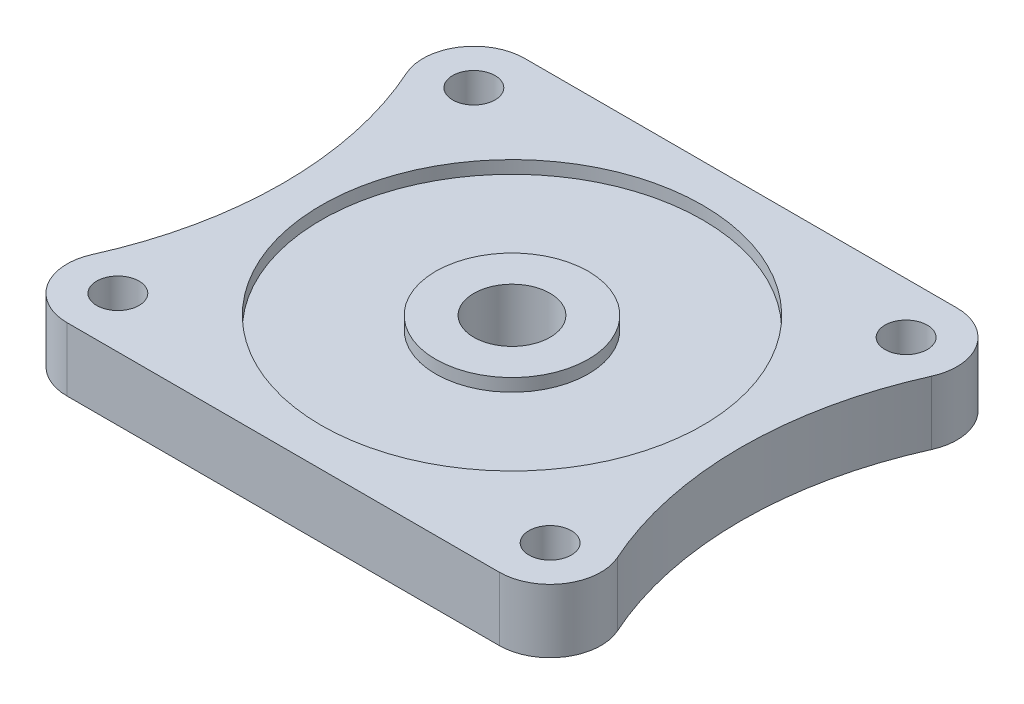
ISO-10303-21;
HEADER;
FILE_DESCRIPTION(('STEP AP214'),'2;1');
FILE_NAME('part.step','',(''),(''),'','','');
FILE_SCHEMA(('AUTOMOTIVE_DESIGN { 1 0 10303 214 1 1 1 1 }'));
ENDSEC;
DATA;
#1=APPLICATION_CONTEXT('core data for automotive mechanical design processes');
#2=APPLICATION_PROTOCOL_DEFINITION('international standard','automotive_design',2000,#1);
#3=PRODUCT_CONTEXT('',#1,'mechanical');
#4=PRODUCT('Part','Part','',(#3));
#5=PRODUCT_RELATED_PRODUCT_CATEGORY('part','',(#4));
#6=PRODUCT_DEFINITION_FORMATION('','',#4);
#7=PRODUCT_DEFINITION_CONTEXT('part definition',#1,'design');
#8=PRODUCT_DEFINITION('design','',#6,#7);
#9=PRODUCT_DEFINITION_SHAPE('','',#8);
#10=(LENGTH_UNIT() NAMED_UNIT(*) SI_UNIT(.MILLI.,.METRE.));
#11=(NAMED_UNIT(*) PLANE_ANGLE_UNIT() SI_UNIT($,.RADIAN.));
#12=(NAMED_UNIT(*) SI_UNIT($,.STERADIAN.) SOLID_ANGLE_UNIT());
#13=UNCERTAINTY_MEASURE_WITH_UNIT(LENGTH_MEASURE(1.E-05),#10,'distance_accuracy_value','');
#14=(GEOMETRIC_REPRESENTATION_CONTEXT(3) GLOBAL_UNCERTAINTY_ASSIGNED_CONTEXT((#13)) GLOBAL_UNIT_ASSIGNED_CONTEXT((#10,
#11,#12)) REPRESENTATION_CONTEXT('',''));
#15=CARTESIAN_POINT('',(0.,0.,0.));
#16=DIRECTION('',(0.,0.,1.));
#17=DIRECTION('',(1.,0.,0.));
#18=AXIS2_PLACEMENT_3D('',#15,#16,#17);
#19=CARTESIAN_POINT('',(-51.,-7.5,-42.));
#20=DIRECTION('',(0.,1.,0.));
#21=DIRECTION('',(0.,0.,1.));
#22=AXIS2_PLACEMENT_3D('',#19,#20,#21);
#23=PLANE('',#22);
#24=CARTESIAN_POINT('',(51.,-7.5,42.));
#25=DIRECTION('',(0.,1.,0.));
#26=DIRECTION('',(0.,0.,1.));
#27=AXIS2_PLACEMENT_3D('',#24,#25,#26);
#28=CIRCLE('',#27,5.00000000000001);
#29=CARTESIAN_POINT('',(51.,-7.5,47.));
#30=VERTEX_POINT('',#29);
#31=EDGE_CURVE('E192',#30,#30,#28,.T.);
#32=ORIENTED_EDGE('',*,*,#31,.T.);
#33=EDGE_LOOP('',(#32));
#34=FACE_BOUND('',#33,.T.);
#35=CARTESIAN_POINT('',(-51.,-7.5,-42.));
#36=DIRECTION('',(0.,1.,0.));
#37=DIRECTION('',(0.,0.,1.));
#38=AXIS2_PLACEMENT_3D('',#35,#36,#37);
#39=CIRCLE('',#38,5.);
#40=CARTESIAN_POINT('',(-51.,-7.5,-37.));
#41=VERTEX_POINT('',#40);
#42=EDGE_CURVE('E180',#41,#41,#39,.T.);
#43=ORIENTED_EDGE('',*,*,#42,.T.);
#44=EDGE_LOOP('',(#43));
#45=FACE_BOUND('',#44,.T.);
#46=CARTESIAN_POINT('',(-51.,-7.5,-42.));
#47=DIRECTION('',(0.,1.,0.));
#48=DIRECTION('',(0.,0.,1.));
#49=AXIS2_PLACEMENT_3D('',#46,#47,#48);
#50=CIRCLE('',#49,12.);
#51=CARTESIAN_POINT('',(-51.,-7.5,-54.));
#52=VERTEX_POINT('',#51);
#53=CARTESIAN_POINT('',(-61.9463414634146,-7.5,-37.0829268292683));
#54=VERTEX_POINT('',#53);
#55=EDGE_CURVE('E132',#52,#54,#50,.T.);
#56=ORIENTED_EDGE('',*,*,#55,.F.);
#57=DIRECTION('',(-1.,0.,0.));
#58=VECTOR('',#57,1.);
#59=CARTESIAN_POINT('',(-51.,-7.5,-54.));
#60=LINE('',#59,#58);
#61=CARTESIAN_POINT('',(51.,-7.5,-54.));
#62=VERTEX_POINT('',#61);
#63=EDGE_CURVE('E86',#62,#52,#60,.T.);
#64=ORIENTED_EDGE('',*,*,#63,.F.);
#65=CARTESIAN_POINT('',(51.,-7.5,-42.));
#66=DIRECTION('',(0.,1.,0.));
#67=DIRECTION('',(0.,0.,1.));
#68=AXIS2_PLACEMENT_3D('',#65,#66,#67);
#69=CIRCLE('',#68,12.);
#70=CARTESIAN_POINT('',(61.9463414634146,-7.5,-37.0829268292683));
#71=VERTEX_POINT('',#70);
#72=EDGE_CURVE('E80',#71,#62,#69,.T.);
#73=ORIENTED_EDGE('',*,*,#72,.F.);
#74=CARTESIAN_POINT('',(144.5,-7.5,0.));
#75=DIRECTION('',(0.,-1.,0.));
#76=DIRECTION('',(0.,0.,-1.));
#77=AXIS2_PLACEMENT_3D('',#74,#75,#76);
#78=CIRCLE('',#77,90.5);
#79=CARTESIAN_POINT('',(61.9463414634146,-7.5,37.0829268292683));
#80=VERTEX_POINT('',#79);
#81=EDGE_CURVE('E122',#80,#71,#78,.T.);
#82=ORIENTED_EDGE('',*,*,#81,.F.);
#83=CARTESIAN_POINT('',(51.,-7.5,42.));
#84=DIRECTION('',(0.,1.,0.));
#85=DIRECTION('',(0.,0.,1.));
#86=AXIS2_PLACEMENT_3D('',#83,#84,#85);
#87=CIRCLE('',#86,12.);
#88=CARTESIAN_POINT('',(51.,-7.5,54.));
#89=VERTEX_POINT('',#88);
#90=EDGE_CURVE('E142',#89,#80,#87,.T.);
#91=ORIENTED_EDGE('',*,*,#90,.F.);
#92=DIRECTION('',(1.,0.,0.));
#93=VECTOR('',#92,1.);
#94=CARTESIAN_POINT('',(-51.,-7.5,54.));
#95=LINE('',#94,#93);
#96=CARTESIAN_POINT('',(-51.,-7.5,54.));
#97=VERTEX_POINT('',#96);
#98=EDGE_CURVE('E140',#97,#89,#95,.T.);
#99=ORIENTED_EDGE('',*,*,#98,.F.);
#100=CARTESIAN_POINT('',(-51.,-7.5,42.));
#101=DIRECTION('',(0.,1.,0.));
#102=DIRECTION('',(0.,0.,1.));
#103=AXIS2_PLACEMENT_3D('',#100,#101,#102);
#104=CIRCLE('',#103,12.);
#105=CARTESIAN_POINT('',(-61.9463414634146,-7.5,37.0829268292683));
#106=VERTEX_POINT('',#105);
#107=EDGE_CURVE('E138',#106,#97,#104,.T.);
#108=ORIENTED_EDGE('',*,*,#107,.F.);
#109=CARTESIAN_POINT('',(-144.5,-7.5,0.));
#110=DIRECTION('',(0.,-1.,0.));
#111=DIRECTION('',(0.,0.,1.));
#112=AXIS2_PLACEMENT_3D('',#109,#110,#111);
#113=CIRCLE('',#112,90.5);
#114=EDGE_CURVE('E135',#54,#106,#113,.T.);
#115=ORIENTED_EDGE('',*,*,#114,.F.);
#116=EDGE_LOOP('',(#56,#64,#73,#82,#91,#99,#108,#115));
#117=FACE_BOUND('',#116,.T.);
#118=CARTESIAN_POINT('',(51.,-7.5,-42.));
#119=DIRECTION('',(0.,1.,0.));
#120=DIRECTION('',(0.,0.,1.));
#121=AXIS2_PLACEMENT_3D('',#118,#119,#120);
#122=CIRCLE('',#121,5.00000000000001);
#123=CARTESIAN_POINT('',(51.,-7.5,-37.));
#124=VERTEX_POINT('',#123);
#125=EDGE_CURVE('E186',#124,#124,#122,.T.);
#126=ORIENTED_EDGE('',*,*,#125,.T.);
#127=EDGE_LOOP('',(#126));
#128=FACE_BOUND('',#127,.T.);
#129=CARTESIAN_POINT('',(-51.,-7.5,42.));
#130=DIRECTION('',(0.,1.,0.));
#131=DIRECTION('',(0.,0.,1.));
#132=AXIS2_PLACEMENT_3D('',#129,#130,#131);
#133=CIRCLE('',#132,5.00000000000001);
#134=CARTESIAN_POINT('',(-51.,-7.5,47.));
#135=VERTEX_POINT('',#134);
#136=EDGE_CURVE('E198',#135,#135,#133,.T.);
#137=ORIENTED_EDGE('',*,*,#136,.T.);
#138=EDGE_LOOP('',(#137));
#139=FACE_BOUND('',#138,.T.);
#140=CARTESIAN_POINT('',(0.,-7.5,0.));
#141=DIRECTION('',(0.,1.,0.));
#142=DIRECTION('',(0.,0.,1.));
#143=AXIS2_PLACEMENT_3D('',#140,#141,#142);
#144=CIRCLE('',#143,45.);
#145=CARTESIAN_POINT('',(0.,-7.5,45.));
#146=VERTEX_POINT('',#145);
#147=EDGE_CURVE('E222',#146,#146,#144,.T.);
#148=ORIENTED_EDGE('',*,*,#147,.T.);
#149=EDGE_LOOP('',(#148));
#150=FACE_BOUND('',#149,.T.);
#151=ADVANCED_FACE('F34',(#34,#45,#117,#128,#139,#150),#23,.F.);
#152=CARTESIAN_POINT('',(-51.,7.5,-42.));
#153=DIRECTION('',(0.,1.,0.));
#154=DIRECTION('',(0.,0.,1.));
#155=AXIS2_PLACEMENT_3D('',#152,#153,#154);
#156=PLANE('',#155);
#157=CARTESIAN_POINT('',(0.,7.5,0.));
#158=DIRECTION('',(0.,1.,0.));
#159=DIRECTION('',(0.,0.,1.));
#160=AXIS2_PLACEMENT_3D('',#157,#158,#159);
#161=CIRCLE('',#160,9.);
#162=CARTESIAN_POINT('',(0.,7.5,9.));
#163=VERTEX_POINT('',#162);
#164=EDGE_CURVE('E204',#163,#163,#161,.T.);
#165=ORIENTED_EDGE('',*,*,#164,.F.);
#166=EDGE_LOOP('',(#165));
#167=FACE_BOUND('',#166,.T.);
#168=CARTESIAN_POINT('',(0.,7.5,0.));
#169=DIRECTION('',(0.,1.,0.));
#170=DIRECTION('',(0.,0.,1.));
#171=AXIS2_PLACEMENT_3D('',#168,#169,#170);
#172=CIRCLE('',#171,18.);
#173=CARTESIAN_POINT('',(0.,7.5,18.));
#174=VERTEX_POINT('',#173);
#175=EDGE_CURVE('E216',#174,#174,#172,.T.);
#176=ORIENTED_EDGE('',*,*,#175,.T.);
#177=EDGE_LOOP('',(#176));
#178=FACE_BOUND('',#177,.T.);
#179=ADVANCED_FACE('F257',(#167,#178),#156,.T.);
#180=CARTESIAN_POINT('',(0.,7.5,0.));
#181=DIRECTION('',(0.,1.,0.));
#182=DIRECTION('',(0.,0.,1.));
#183=AXIS2_PLACEMENT_3D('',#180,#181,#182);
#184=CIRCLE('',#183,45.);
#185=CARTESIAN_POINT('',(0.,7.5,45.));
#186=VERTEX_POINT('',#185);
#187=EDGE_CURVE('E210',#186,#186,#184,.T.);
#188=ORIENTED_EDGE('',*,*,#187,.F.);
#189=EDGE_LOOP('',(#188));
#190=FACE_BOUND('',#189,.T.);
#191=CARTESIAN_POINT('',(51.,7.5,42.));
#192=DIRECTION('',(0.,1.,0.));
#193=DIRECTION('',(0.,0.,1.));
#194=AXIS2_PLACEMENT_3D('',#191,#192,#193);
#195=CIRCLE('',#194,5.00000000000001);
#196=CARTESIAN_POINT('',(51.,7.5,47.));
#197=VERTEX_POINT('',#196);
#198=EDGE_CURVE('E189',#197,#197,#195,.T.);
#199=ORIENTED_EDGE('',*,*,#198,.F.);
#200=EDGE_LOOP('',(#199));
#201=FACE_BOUND('',#200,.T.);
#202=CARTESIAN_POINT('',(-51.,7.5,-42.));
#203=DIRECTION('',(0.,1.,0.));
#204=DIRECTION('',(0.,0.,1.));
#205=AXIS2_PLACEMENT_3D('',#202,#203,#204);
#206=CIRCLE('',#205,5.);
#207=CARTESIAN_POINT('',(-51.,7.5,-37.));
#208=VERTEX_POINT('',#207);
#209=EDGE_CURVE('E136',#208,#208,#206,.T.);
#210=ORIENTED_EDGE('',*,*,#209,.F.);
#211=EDGE_LOOP('',(#210));
#212=FACE_BOUND('',#211,.T.);
#213=CARTESIAN_POINT('',(-51.,7.5,-42.));
#214=DIRECTION('',(0.,1.,0.));
#215=DIRECTION('',(0.,0.,1.));
#216=AXIS2_PLACEMENT_3D('',#213,#214,#215);
#217=CIRCLE('',#216,12.);
#218=CARTESIAN_POINT('',(-51.,7.5,-54.));
#219=VERTEX_POINT('',#218);
#220=CARTESIAN_POINT('',(-61.9463414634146,7.5,-37.0829268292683));
#221=VERTEX_POINT('',#220);
#222=EDGE_CURVE('E147',#219,#221,#217,.T.);
#223=ORIENTED_EDGE('',*,*,#222,.T.);
#224=CARTESIAN_POINT('',(-144.5,7.5,0.));
#225=DIRECTION('',(0.,-1.,0.));
#226=DIRECTION('',(0.,0.,1.));
#227=AXIS2_PLACEMENT_3D('',#224,#225,#226);
#228=CIRCLE('',#227,90.5);
#229=CARTESIAN_POINT('',(-61.9463414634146,7.5,37.0829268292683));
#230=VERTEX_POINT('',#229);
#231=EDGE_CURVE('E94',#221,#230,#228,.T.);
#232=ORIENTED_EDGE('',*,*,#231,.T.);
#233=CARTESIAN_POINT('',(-51.,7.5,42.));
#234=DIRECTION('',(0.,1.,0.));
#235=DIRECTION('',(0.,0.,1.));
#236=AXIS2_PLACEMENT_3D('',#233,#234,#235);
#237=CIRCLE('',#236,12.);
#238=CARTESIAN_POINT('',(-51.,7.5,54.));
#239=VERTEX_POINT('',#238);
#240=EDGE_CURVE('E162',#230,#239,#237,.T.);
#241=ORIENTED_EDGE('',*,*,#240,.T.);
#242=DIRECTION('',(1.,0.,0.));
#243=VECTOR('',#242,1.);
#244=CARTESIAN_POINT('',(-51.,7.5,54.));
#245=LINE('',#244,#243);
#246=CARTESIAN_POINT('',(51.,7.5,54.));
#247=VERTEX_POINT('',#246);
#248=EDGE_CURVE('E174',#239,#247,#245,.T.);
#249=ORIENTED_EDGE('',*,*,#248,.T.);
#250=CARTESIAN_POINT('',(51.,7.5,42.));
#251=DIRECTION('',(0.,1.,0.));
#252=DIRECTION('',(0.,0.,1.));
#253=AXIS2_PLACEMENT_3D('',#250,#251,#252);
#254=CIRCLE('',#253,12.);
#255=CARTESIAN_POINT('',(61.9463414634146,7.5,37.0829268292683));
#256=VERTEX_POINT('',#255);
#257=EDGE_CURVE('E114',#247,#256,#254,.T.);
#258=ORIENTED_EDGE('',*,*,#257,.T.);
#259=CARTESIAN_POINT('',(144.5,7.5,0.));
#260=DIRECTION('',(0.,-1.,0.));
#261=DIRECTION('',(0.,0.,-1.));
#262=AXIS2_PLACEMENT_3D('',#259,#260,#261);
#263=CIRCLE('',#262,90.5);
#264=CARTESIAN_POINT('',(61.9463414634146,7.5,-37.0829268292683));
#265=VERTEX_POINT('',#264);
#266=EDGE_CURVE('E107',#256,#265,#263,.T.);
#267=ORIENTED_EDGE('',*,*,#266,.T.);
#268=CARTESIAN_POINT('',(51.,7.5,-42.));
#269=DIRECTION('',(0.,1.,0.));
#270=DIRECTION('',(0.,0.,1.));
#271=AXIS2_PLACEMENT_3D('',#268,#269,#270);
#272=CIRCLE('',#271,12.);
#273=CARTESIAN_POINT('',(51.,7.5,-54.));
#274=VERTEX_POINT('',#273);
#275=EDGE_CURVE('E112',#265,#274,#272,.T.);
#276=ORIENTED_EDGE('',*,*,#275,.T.);
#277=DIRECTION('',(-1.,0.,0.));
#278=VECTOR('',#277,1.);
#279=CARTESIAN_POINT('',(-51.,7.5,-54.));
#280=LINE('',#279,#278);
#281=EDGE_CURVE('E51',#274,#219,#280,.T.);
#282=ORIENTED_EDGE('',*,*,#281,.T.);
#283=EDGE_LOOP('',(#223,#232,#241,#249,#258,#267,#276,#282));
#284=FACE_BOUND('',#283,.T.);
#285=CARTESIAN_POINT('',(51.,7.5,-42.));
#286=DIRECTION('',(0.,1.,0.));
#287=DIRECTION('',(0.,0.,1.));
#288=AXIS2_PLACEMENT_3D('',#285,#286,#287);
#289=CIRCLE('',#288,5.00000000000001);
#290=CARTESIAN_POINT('',(51.,7.5,-37.));
#291=VERTEX_POINT('',#290);
#292=EDGE_CURVE('E183',#291,#291,#289,.T.);
#293=ORIENTED_EDGE('',*,*,#292,.F.);
#294=EDGE_LOOP('',(#293));
#295=FACE_BOUND('',#294,.T.);
#296=CARTESIAN_POINT('',(-51.,7.5,42.));
#297=DIRECTION('',(0.,1.,0.));
#298=DIRECTION('',(0.,0.,1.));
#299=AXIS2_PLACEMENT_3D('',#296,#297,#298);
#300=CIRCLE('',#299,5.00000000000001);
#301=CARTESIAN_POINT('',(-51.,7.5,47.));
#302=VERTEX_POINT('',#301);
#303=EDGE_CURVE('E195',#302,#302,#300,.T.);
#304=ORIENTED_EDGE('',*,*,#303,.F.);
#305=EDGE_LOOP('',(#304));
#306=FACE_BOUND('',#305,.T.);
#307=ADVANCED_FACE('F109',(#190,#201,#212,#284,#295,#306),#156,.T.);
#308=CARTESIAN_POINT('',(0.,-7.5,0.));
#309=DIRECTION('',(0.,1.,0.));
#310=DIRECTION('',(0.,0.,1.));
#311=AXIS2_PLACEMENT_3D('',#308,#309,#310);
#312=CIRCLE('',#311,18.);
#313=CARTESIAN_POINT('',(0.,-7.5,18.));
#314=VERTEX_POINT('',#313);
#315=EDGE_CURVE('E228',#314,#314,#312,.T.);
#316=ORIENTED_EDGE('',*,*,#315,.F.);
#317=EDGE_LOOP('',(#316));
#318=FACE_BOUND('',#317,.T.);
#319=CARTESIAN_POINT('',(0.,-7.5,0.));
#320=DIRECTION('',(0.,1.,0.));
#321=DIRECTION('',(0.,0.,1.));
#322=AXIS2_PLACEMENT_3D('',#319,#320,#321);
#323=CIRCLE('',#322,9.);
#324=CARTESIAN_POINT('',(0.,-7.5,9.));
#325=VERTEX_POINT('',#324);
#326=EDGE_CURVE('E201',#325,#325,#323,.T.);
#327=ORIENTED_EDGE('',*,*,#326,.T.);
#328=EDGE_LOOP('',(#327));
#329=FACE_BOUND('',#328,.T.);
#330=ADVANCED_FACE('F243',(#318,#329),#23,.F.);
#331=CARTESIAN_POINT('',(-51.,7.5,-42.));
#332=DIRECTION('',(0.,-1.,0.));
#333=DIRECTION('',(0.,0.,-1.));
#334=AXIS2_PLACEMENT_3D('',#331,#332,#333);
#335=CYLINDRICAL_SURFACE('',#334,12.);
#336=ORIENTED_EDGE('',*,*,#55,.T.);
#337=DIRECTION('',(0.,-1.,0.));
#338=VECTOR('',#337,1.);
#339=CARTESIAN_POINT('',(-61.9463414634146,7.5,-37.0829268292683));
#340=LINE('',#339,#338);
#341=EDGE_CURVE('E11',#221,#54,#340,.T.);
#342=ORIENTED_EDGE('',*,*,#341,.F.);
#343=ORIENTED_EDGE('',*,*,#222,.F.);
#344=DIRECTION('',(0.,-1.,0.));
#345=VECTOR('',#344,1.);
#346=CARTESIAN_POINT('',(-51.,7.5,-54.));
#347=LINE('',#346,#345);
#348=EDGE_CURVE('E128',#219,#52,#347,.T.);
#349=ORIENTED_EDGE('',*,*,#348,.T.);
#350=EDGE_LOOP('',(#336,#342,#343,#349));
#351=FACE_BOUND('',#350,.T.);
#352=ADVANCED_FACE('F36',(#351),#335,.T.);
#353=CARTESIAN_POINT('',(-144.5,7.5,0.));
#354=DIRECTION('',(0.,-1.,0.));
#355=DIRECTION('',(0.,0.,-1.));
#356=AXIS2_PLACEMENT_3D('',#353,#354,#355);
#357=CYLINDRICAL_SURFACE('',#356,90.5);
#358=ORIENTED_EDGE('',*,*,#114,.T.);
#359=DIRECTION('',(0.,-1.,0.));
#360=VECTOR('',#359,1.);
#361=CARTESIAN_POINT('',(-61.9463414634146,7.5,37.0829268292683));
#362=LINE('',#361,#360);
#363=EDGE_CURVE('E43',#230,#106,#362,.T.);
#364=ORIENTED_EDGE('',*,*,#363,.F.);
#365=ORIENTED_EDGE('',*,*,#231,.F.);
#366=ORIENTED_EDGE('',*,*,#341,.T.);
#367=EDGE_LOOP('',(#358,#364,#365,#366));
#368=FACE_BOUND('',#367,.T.);
#369=ADVANCED_FACE('F297',(#368),#357,.F.);
#370=CARTESIAN_POINT('',(-51.,7.5,42.));
#371=DIRECTION('',(0.,-1.,0.));
#372=DIRECTION('',(0.,0.,-1.));
#373=AXIS2_PLACEMENT_3D('',#370,#371,#372);
#374=CYLINDRICAL_SURFACE('',#373,12.);
#375=ORIENTED_EDGE('',*,*,#107,.T.);
#376=DIRECTION('',(0.,-1.,0.));
#377=VECTOR('',#376,1.);
#378=CARTESIAN_POINT('',(-51.,7.5,54.));
#379=LINE('',#378,#377);
#380=EDGE_CURVE('E154',#239,#97,#379,.T.);
#381=ORIENTED_EDGE('',*,*,#380,.F.);
#382=ORIENTED_EDGE('',*,*,#240,.F.);
#383=ORIENTED_EDGE('',*,*,#363,.T.);
#384=EDGE_LOOP('',(#375,#381,#382,#383));
#385=FACE_BOUND('',#384,.T.);
#386=ADVANCED_FACE('F160',(#385),#374,.T.);
#387=CARTESIAN_POINT('',(-51.,7.5,54.));
#388=DIRECTION('',(0.,0.,-1.));
#389=DIRECTION('',(-1.,0.,0.));
#390=AXIS2_PLACEMENT_3D('',#387,#388,#389);
#391=PLANE('',#390);
#392=ORIENTED_EDGE('',*,*,#98,.T.);
#393=DIRECTION('',(0.,-1.,0.));
#394=VECTOR('',#393,1.);
#395=CARTESIAN_POINT('',(51.,7.5,54.));
#396=LINE('',#395,#394);
#397=EDGE_CURVE('E151',#247,#89,#396,.T.);
#398=ORIENTED_EDGE('',*,*,#397,.F.);
#399=ORIENTED_EDGE('',*,*,#248,.F.);
#400=ORIENTED_EDGE('',*,*,#380,.T.);
#401=EDGE_LOOP('',(#392,#398,#399,#400));
#402=FACE_BOUND('',#401,.T.);
#403=ADVANCED_FACE('F170',(#402),#391,.F.);
#404=CARTESIAN_POINT('',(51.,7.5,42.));
#405=DIRECTION('',(0.,-1.,0.));
#406=DIRECTION('',(0.,0.,-1.));
#407=AXIS2_PLACEMENT_3D('',#404,#405,#406);
#408=CYLINDRICAL_SURFACE('',#407,12.);
#409=ORIENTED_EDGE('',*,*,#90,.T.);
#410=DIRECTION('',(0.,-1.,0.));
#411=VECTOR('',#410,1.);
#412=CARTESIAN_POINT('',(61.9463414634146,7.5,37.0829268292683));
#413=LINE('',#412,#411);
#414=EDGE_CURVE('E123',#256,#80,#413,.T.);
#415=ORIENTED_EDGE('',*,*,#414,.F.);
#416=ORIENTED_EDGE('',*,*,#257,.F.);
#417=ORIENTED_EDGE('',*,*,#397,.T.);
#418=EDGE_LOOP('',(#409,#415,#416,#417));
#419=FACE_BOUND('',#418,.T.);
#420=ADVANCED_FACE('F173',(#419),#408,.T.);
#421=CARTESIAN_POINT('',(144.5,7.5,0.));
#422=DIRECTION('',(0.,-1.,0.));
#423=DIRECTION('',(0.,0.,-1.));
#424=AXIS2_PLACEMENT_3D('',#421,#422,#423);
#425=CYLINDRICAL_SURFACE('',#424,90.5);
#426=ORIENTED_EDGE('',*,*,#81,.T.);
#427=DIRECTION('',(0.,-1.,0.));
#428=VECTOR('',#427,1.);
#429=CARTESIAN_POINT('',(61.9463414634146,7.5,-37.0829268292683));
#430=LINE('',#429,#428);
#431=EDGE_CURVE('E119',#265,#71,#430,.T.);
#432=ORIENTED_EDGE('',*,*,#431,.F.);
#433=ORIENTED_EDGE('',*,*,#266,.F.);
#434=ORIENTED_EDGE('',*,*,#414,.T.);
#435=EDGE_LOOP('',(#426,#432,#433,#434));
#436=FACE_BOUND('',#435,.T.);
#437=ADVANCED_FACE('F120',(#436),#425,.F.);
#438=CARTESIAN_POINT('',(51.,7.5,-42.));
#439=DIRECTION('',(0.,-1.,0.));
#440=DIRECTION('',(0.,0.,-1.));
#441=AXIS2_PLACEMENT_3D('',#438,#439,#440);
#442=CYLINDRICAL_SURFACE('',#441,12.);
#443=ORIENTED_EDGE('',*,*,#72,.T.);
#444=DIRECTION('',(0.,-1.,0.));
#445=VECTOR('',#444,1.);
#446=CARTESIAN_POINT('',(51.,7.5,-54.));
#447=LINE('',#446,#445);
#448=EDGE_CURVE('E124',#274,#62,#447,.T.);
#449=ORIENTED_EDGE('',*,*,#448,.F.);
#450=ORIENTED_EDGE('',*,*,#275,.F.);
#451=ORIENTED_EDGE('',*,*,#431,.T.);
#452=EDGE_LOOP('',(#443,#449,#450,#451));
#453=FACE_BOUND('',#452,.T.);
#454=ADVANCED_FACE('F126',(#453),#442,.T.);
#455=CARTESIAN_POINT('',(-51.,7.5,-54.));
#456=DIRECTION('',(0.,0.,1.));
#457=DIRECTION('',(1.,0.,0.));
#458=AXIS2_PLACEMENT_3D('',#455,#456,#457);
#459=PLANE('',#458);
#460=ORIENTED_EDGE('',*,*,#63,.T.);
#461=ORIENTED_EDGE('',*,*,#348,.F.);
#462=ORIENTED_EDGE('',*,*,#281,.F.);
#463=ORIENTED_EDGE('',*,*,#448,.T.);
#464=EDGE_LOOP('',(#460,#461,#462,#463));
#465=FACE_BOUND('',#464,.T.);
#466=ADVANCED_FACE('F284',(#465),#459,.F.);
#467=CARTESIAN_POINT('',(-51.,7.5,-42.));
#468=DIRECTION('',(0.,-1.,0.));
#469=DIRECTION('',(0.,0.,-1.));
#470=AXIS2_PLACEMENT_3D('',#467,#468,#469);
#471=CYLINDRICAL_SURFACE('',#470,5.);
#472=ORIENTED_EDGE('',*,*,#209,.T.);
#473=EDGE_LOOP('',(#472));
#474=FACE_BOUND('',#473,.T.);
#475=ORIENTED_EDGE('',*,*,#42,.F.);
#476=EDGE_LOOP('',(#475));
#477=FACE_BOUND('',#476,.T.);
#478=ADVANCED_FACE('F287',(#474,#477),#471,.F.);
#479=CARTESIAN_POINT('',(51.,7.5,-42.));
#480=DIRECTION('',(0.,-1.,0.));
#481=DIRECTION('',(0.,0.,-1.));
#482=AXIS2_PLACEMENT_3D('',#479,#480,#481);
#483=CYLINDRICAL_SURFACE('',#482,5.00000000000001);
#484=ORIENTED_EDGE('',*,*,#292,.T.);
#485=EDGE_LOOP('',(#484));
#486=FACE_BOUND('',#485,.T.);
#487=ORIENTED_EDGE('',*,*,#125,.F.);
#488=EDGE_LOOP('',(#487));
#489=FACE_BOUND('',#488,.T.);
#490=ADVANCED_FACE('F350',(#486,#489),#483,.F.);
#491=CARTESIAN_POINT('',(51.,7.5,42.));
#492=DIRECTION('',(0.,-1.,0.));
#493=DIRECTION('',(0.,0.,-1.));
#494=AXIS2_PLACEMENT_3D('',#491,#492,#493);
#495=CYLINDRICAL_SURFACE('',#494,5.00000000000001);
#496=ORIENTED_EDGE('',*,*,#198,.T.);
#497=EDGE_LOOP('',(#496));
#498=FACE_BOUND('',#497,.T.);
#499=ORIENTED_EDGE('',*,*,#31,.F.);
#500=EDGE_LOOP('',(#499));
#501=FACE_BOUND('',#500,.T.);
#502=ADVANCED_FACE('F340',(#498,#501),#495,.F.);
#503=CARTESIAN_POINT('',(-51.,7.5,42.));
#504=DIRECTION('',(0.,-1.,0.));
#505=DIRECTION('',(0.,0.,-1.));
#506=AXIS2_PLACEMENT_3D('',#503,#504,#505);
#507=CYLINDRICAL_SURFACE('',#506,5.00000000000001);
#508=ORIENTED_EDGE('',*,*,#303,.T.);
#509=EDGE_LOOP('',(#508));
#510=FACE_BOUND('',#509,.T.);
#511=ORIENTED_EDGE('',*,*,#136,.F.);
#512=EDGE_LOOP('',(#511));
#513=FACE_BOUND('',#512,.T.);
#514=ADVANCED_FACE('F253',(#510,#513),#507,.F.);
#515=CARTESIAN_POINT('',(0.,-7.5,0.));
#516=DIRECTION('',(0.,1.,0.));
#517=DIRECTION('',(0.,0.,1.));
#518=AXIS2_PLACEMENT_3D('',#515,#516,#517);
#519=CYLINDRICAL_SURFACE('',#518,9.);
#520=ORIENTED_EDGE('',*,*,#326,.F.);
#521=EDGE_LOOP('',(#520));
#522=FACE_BOUND('',#521,.T.);
#523=ORIENTED_EDGE('',*,*,#164,.T.);
#524=EDGE_LOOP('',(#523));
#525=FACE_BOUND('',#524,.T.);
#526=ADVANCED_FACE('F249',(#522,#525),#519,.F.);
#527=CARTESIAN_POINT('',(0.,4.5,0.));
#528=DIRECTION('',(0.,1.,0.));
#529=DIRECTION('',(0.,0.,1.));
#530=AXIS2_PLACEMENT_3D('',#527,#528,#529);
#531=CYLINDRICAL_SURFACE('',#530,45.);
#532=CARTESIAN_POINT('',(0.,4.5,0.));
#533=DIRECTION('',(0.,1.,0.));
#534=DIRECTION('',(0.,0.,1.));
#535=AXIS2_PLACEMENT_3D('',#532,#533,#534);
#536=CIRCLE('',#535,45.);
#537=CARTESIAN_POINT('',(0.,4.5,45.));
#538=VERTEX_POINT('',#537);
#539=EDGE_CURVE('E207',#538,#538,#536,.T.);
#540=ORIENTED_EDGE('',*,*,#539,.F.);
#541=EDGE_LOOP('',(#540));
#542=FACE_BOUND('',#541,.T.);
#543=ORIENTED_EDGE('',*,*,#187,.T.);
#544=EDGE_LOOP('',(#543));
#545=FACE_BOUND('',#544,.T.);
#546=ADVANCED_FACE('F252',(#542,#545),#531,.F.);
#547=CARTESIAN_POINT('',(0.,4.5,0.));
#548=DIRECTION('',(0.,1.,0.));
#549=DIRECTION('',(0.,0.,1.));
#550=AXIS2_PLACEMENT_3D('',#547,#548,#549);
#551=PLANE('',#550);
#552=CARTESIAN_POINT('',(0.,4.5,0.));
#553=DIRECTION('',(0.,1.,0.));
#554=DIRECTION('',(0.,0.,1.));
#555=AXIS2_PLACEMENT_3D('',#552,#553,#554);
#556=CIRCLE('',#555,18.);
#557=CARTESIAN_POINT('',(0.,4.5,18.));
#558=VERTEX_POINT('',#557);
#559=EDGE_CURVE('E213',#558,#558,#556,.T.);
#560=ORIENTED_EDGE('',*,*,#559,.F.);
#561=EDGE_LOOP('',(#560));
#562=FACE_BOUND('',#561,.T.);
#563=ORIENTED_EDGE('',*,*,#539,.T.);
#564=EDGE_LOOP('',(#563));
#565=FACE_BOUND('',#564,.T.);
#566=ADVANCED_FACE('F265',(#562,#565),#551,.T.);
#567=CARTESIAN_POINT('',(0.,4.5,0.));
#568=DIRECTION('',(0.,1.,0.));
#569=DIRECTION('',(0.,0.,1.));
#570=AXIS2_PLACEMENT_3D('',#567,#568,#569);
#571=CYLINDRICAL_SURFACE('',#570,18.);
#572=ORIENTED_EDGE('',*,*,#559,.T.);
#573=EDGE_LOOP('',(#572));
#574=FACE_BOUND('',#573,.T.);
#575=ORIENTED_EDGE('',*,*,#175,.F.);
#576=EDGE_LOOP('',(#575));
#577=FACE_BOUND('',#576,.T.);
#578=ADVANCED_FACE('F263',(#574,#577),#571,.T.);
#579=CARTESIAN_POINT('',(0.,-4.5,0.));
#580=DIRECTION('',(0.,-1.,0.));
#581=DIRECTION('',(0.,0.,1.));
#582=AXIS2_PLACEMENT_3D('',#579,#580,#581);
#583=PLANE('',#582);
#584=CARTESIAN_POINT('',(0.,-4.5,0.));
#585=DIRECTION('',(0.,1.,0.));
#586=DIRECTION('',(0.,0.,1.));
#587=AXIS2_PLACEMENT_3D('',#584,#585,#586);
#588=CIRCLE('',#587,45.);
#589=CARTESIAN_POINT('',(0.,-4.5,45.));
#590=VERTEX_POINT('',#589);
#591=EDGE_CURVE('E219',#590,#590,#588,.T.);
#592=ORIENTED_EDGE('',*,*,#591,.F.);
#593=EDGE_LOOP('',(#592));
#594=FACE_BOUND('',#593,.T.);
#595=CARTESIAN_POINT('',(0.,-4.5,0.));
#596=DIRECTION('',(0.,1.,0.));
#597=DIRECTION('',(0.,0.,1.));
#598=AXIS2_PLACEMENT_3D('',#595,#596,#597);
#599=CIRCLE('',#598,18.);
#600=CARTESIAN_POINT('',(0.,-4.5,18.));
#601=VERTEX_POINT('',#600);
#602=EDGE_CURVE('E225',#601,#601,#599,.T.);
#603=ORIENTED_EDGE('',*,*,#602,.T.);
#604=EDGE_LOOP('',(#603));
#605=FACE_BOUND('',#604,.T.);
#606=ADVANCED_FACE('F234',(#594,#605),#583,.T.);
#607=CARTESIAN_POINT('',(0.,-4.5,0.));
#608=DIRECTION('',(0.,-1.,0.));
#609=DIRECTION('',(0.,0.,-1.));
#610=AXIS2_PLACEMENT_3D('',#607,#608,#609);
#611=CYLINDRICAL_SURFACE('',#610,45.);
#612=ORIENTED_EDGE('',*,*,#591,.T.);
#613=EDGE_LOOP('',(#612));
#614=FACE_BOUND('',#613,.T.);
#615=ORIENTED_EDGE('',*,*,#147,.F.);
#616=EDGE_LOOP('',(#615));
#617=FACE_BOUND('',#616,.T.);
#618=ADVANCED_FACE('F239',(#614,#617),#611,.F.);
#619=CARTESIAN_POINT('',(0.,-4.5,0.));
#620=DIRECTION('',(0.,-1.,0.));
#621=DIRECTION('',(0.,0.,-1.));
#622=AXIS2_PLACEMENT_3D('',#619,#620,#621);
#623=CYLINDRICAL_SURFACE('',#622,18.);
#624=ORIENTED_EDGE('',*,*,#602,.F.);
#625=EDGE_LOOP('',(#624));
#626=FACE_BOUND('',#625,.T.);
#627=ORIENTED_EDGE('',*,*,#315,.T.);
#628=EDGE_LOOP('',(#627));
#629=FACE_BOUND('',#628,.T.);
#630=ADVANCED_FACE('F236',(#626,#629),#623,.T.);
#631=CLOSED_SHELL('',(#151,#179,#307,#330,#352,#369,#386,#403,#420,#437,#454,#466,#478,#490,
#502,#514,#526,#546,#566,#578,#606,#618,#630));
#632=MANIFOLD_SOLID_BREP('B2',#631);
#633=ADVANCED_BREP_SHAPE_REPRESENTATION('',(#18,#632),#14);
#634=SHAPE_DEFINITION_REPRESENTATION(#9,#633);
ENDSEC;
END-ISO-10303-21;
